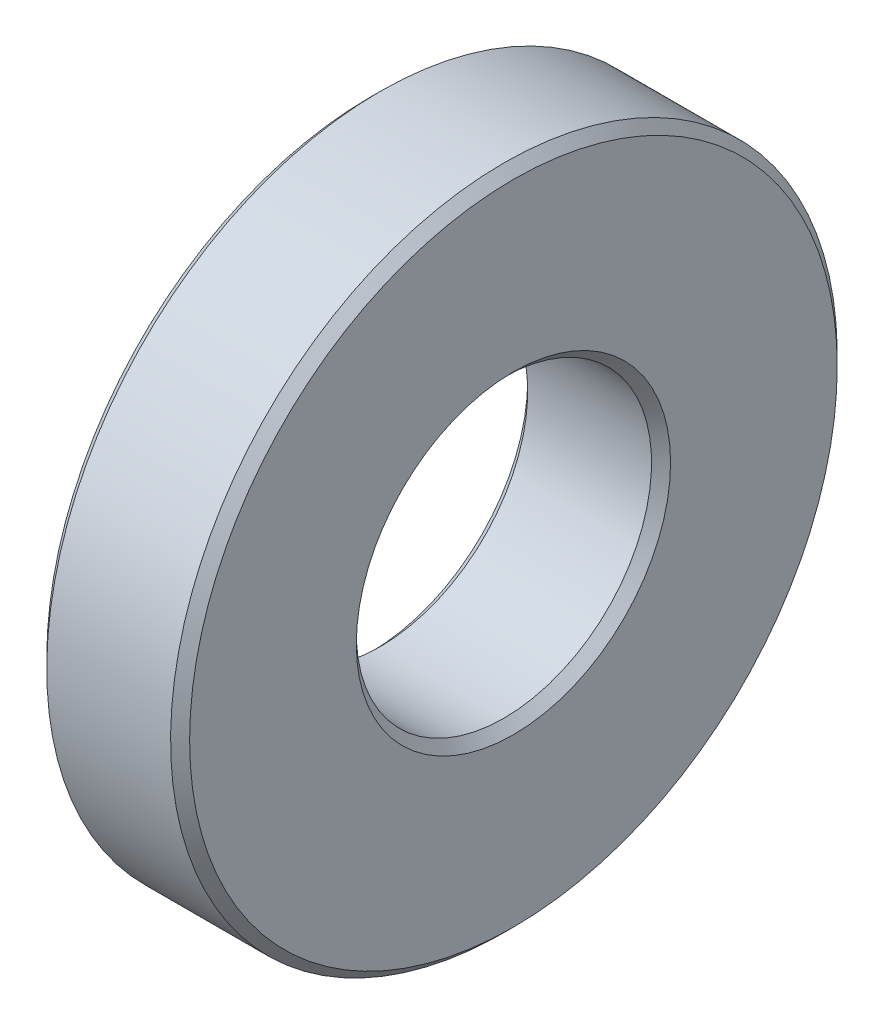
ISO-10303-21;
HEADER;
FILE_DESCRIPTION(('STEP AP214'),'2;1');
FILE_NAME('part.step','',(''),(''),'','','');
FILE_SCHEMA(('AUTOMOTIVE_DESIGN { 1 0 10303 214 1 1 1 1 }'));
ENDSEC;
DATA;
#1=APPLICATION_CONTEXT('core data for automotive mechanical design processes');
#2=APPLICATION_PROTOCOL_DEFINITION('international standard','automotive_design',2000,#1);
#3=PRODUCT_CONTEXT('',#1,'mechanical');
#4=PRODUCT('Part','Part','',(#3));
#5=PRODUCT_RELATED_PRODUCT_CATEGORY('part','',(#4));
#6=PRODUCT_DEFINITION_FORMATION('','',#4);
#7=PRODUCT_DEFINITION_CONTEXT('part definition',#1,'design');
#8=PRODUCT_DEFINITION('design','',#6,#7);
#9=PRODUCT_DEFINITION_SHAPE('','',#8);
#10=(LENGTH_UNIT() NAMED_UNIT(*) SI_UNIT(.MILLI.,.METRE.));
#11=(NAMED_UNIT(*) PLANE_ANGLE_UNIT() SI_UNIT($,.RADIAN.));
#12=(NAMED_UNIT(*) SI_UNIT($,.STERADIAN.) SOLID_ANGLE_UNIT());
#13=UNCERTAINTY_MEASURE_WITH_UNIT(LENGTH_MEASURE(1.E-05),#10,'distance_accuracy_value','');
#14=(GEOMETRIC_REPRESENTATION_CONTEXT(3) GLOBAL_UNCERTAINTY_ASSIGNED_CONTEXT((#13)) GLOBAL_UNIT_ASSIGNED_CONTEXT((#10,
#11,#12)) REPRESENTATION_CONTEXT('',''));
#15=CARTESIAN_POINT('',(0.,0.,0.));
#16=DIRECTION('',(0.,0.,1.));
#17=DIRECTION('',(1.,0.,0.));
#18=AXIS2_PLACEMENT_3D('',#15,#16,#17);
#19=DIRECTION('',(0.707106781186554,0.707106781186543,0.));
#20=VECTOR('',#19,1.);
#21=CARTESIAN_POINT('',(498933.550000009,499000.000000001,-30.5000000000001));
#22=LINE('',#21,#20);
#23=CARTESIAN_POINT('',(-50.7,15.75,-30.5000000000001));
#24=DIRECTION('',(1.,0.,0.));
#25=AXIS1_PLACEMENT('',#23,#24);
#26=SURFACE_OF_REVOLUTION('',#22,#25);
#27=CARTESIAN_POINT('',(-47.5999999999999,15.75,-30.5000000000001));
#28=DIRECTION('',(1.,0.,0.));
#29=DIRECTION('',(0.,1.,0.));
#30=AXIS2_PLACEMENT_3D('',#27,#28,#29);
#31=CIRCLE('',#30,3.1);
#32=CARTESIAN_POINT('',(-47.5999999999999,18.8500000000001,-30.5000000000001));
#33=VERTEX_POINT('',#32);
#34=EDGE_CURVE('E39',#33,#33,#31,.T.);
#35=ORIENTED_EDGE('',*,*,#34,.F.);
#36=EDGE_LOOP('',(#35));
#37=FACE_BOUND('',#36,.T.);
#38=CARTESIAN_POINT('',(-47.3999999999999,15.75,-30.5000000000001));
#39=DIRECTION('',(1.,0.,0.));
#40=DIRECTION('',(0.,1.,0.));
#41=AXIS2_PLACEMENT_3D('',#38,#39,#40);
#42=CIRCLE('',#41,3.3);
#43=CARTESIAN_POINT('',(-47.3999999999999,19.0500000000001,-30.5000000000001));
#44=VERTEX_POINT('',#43);
#45=EDGE_CURVE('E8',#44,#44,#42,.T.);
#46=ORIENTED_EDGE('',*,*,#45,.T.);
#47=EDGE_LOOP('',(#46));
#48=FACE_BOUND('',#47,.T.);
#49=ADVANCED_FACE('F12',(#37,#48),#26,.F.);
#50=CARTESIAN_POINT('',(-47.3999999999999,20.8000000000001,-30.5000000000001));
#51=DIRECTION('',(1.,0.,0.));
#52=DIRECTION('',(0.,0.,-1.));
#53=AXIS2_PLACEMENT_3D('',#50,#51,#52);
#54=PLANE('',#53);
#55=CARTESIAN_POINT('',(-47.3999999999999,15.75,-30.5000000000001));
#56=DIRECTION('',(1.,0.,0.));
#57=DIRECTION('',(0.,1.,0.));
#58=AXIS2_PLACEMENT_3D('',#55,#56,#57);
#59=CIRCLE('',#58,6.8);
#60=CARTESIAN_POINT('',(-47.3999999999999,22.5500000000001,-30.5000000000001));
#61=VERTEX_POINT('',#60);
#62=EDGE_CURVE('E21',#61,#61,#59,.T.);
#63=ORIENTED_EDGE('',*,*,#62,.T.);
#64=EDGE_LOOP('',(#63));
#65=FACE_BOUND('',#64,.T.);
#66=ORIENTED_EDGE('',*,*,#45,.F.);
#67=EDGE_LOOP('',(#66));
#68=FACE_BOUND('',#67,.T.);
#69=ADVANCED_FACE('F58',(#65,#68),#54,.T.);
#70=DIRECTION('',(0.707106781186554,-0.707106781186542,0.));
#71=VECTOR('',#70,1.);
#72=CARTESIAN_POINT('',(-499000.,498975.149999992,-30.5000000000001));
#73=LINE('',#72,#71);
#74=CARTESIAN_POINT('',(-40.5999999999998,15.75,-30.5000000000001));
#75=DIRECTION('',(-1.,0.,0.));
#76=AXIS1_PLACEMENT('',#74,#75);
#77=SURFACE_OF_REVOLUTION('',#73,#76);
#78=CARTESIAN_POINT('',(-47.5999999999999,15.75,-30.5000000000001));
#79=DIRECTION('',(1.,0.,0.));
#80=DIRECTION('',(0.,1.,0.));
#81=AXIS2_PLACEMENT_3D('',#78,#79,#80);
#82=CIRCLE('',#81,7.);
#83=CARTESIAN_POINT('',(-47.5999999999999,22.7500000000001,-30.5000000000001));
#84=VERTEX_POINT('',#83);
#85=EDGE_CURVE('E34',#84,#84,#82,.T.);
#86=ORIENTED_EDGE('',*,*,#85,.T.);
#87=EDGE_LOOP('',(#86));
#88=FACE_BOUND('',#87,.T.);
#89=ORIENTED_EDGE('',*,*,#62,.F.);
#90=EDGE_LOOP('',(#89));
#91=FACE_BOUND('',#90,.T.);
#92=ADVANCED_FACE('F62',(#88,#91),#77,.F.);
#93=CARTESIAN_POINT('',(-48.9,15.75,-30.5000000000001));
#94=DIRECTION('',(-1.,0.,0.));
#95=DIRECTION('',(0.,0.,1.));
#96=AXIS2_PLACEMENT_3D('',#93,#94,#95);
#97=CYLINDRICAL_SURFACE('',#96,7.);
#98=CARTESIAN_POINT('',(-50.2000000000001,15.75,-30.5000000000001));
#99=DIRECTION('',(1.,0.,0.));
#100=DIRECTION('',(0.,1.,0.));
#101=AXIS2_PLACEMENT_3D('',#98,#99,#100);
#102=CIRCLE('',#101,7.);
#103=CARTESIAN_POINT('',(-50.2000000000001,22.7500000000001,-30.5000000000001));
#104=VERTEX_POINT('',#103);
#105=EDGE_CURVE('E30',#104,#104,#102,.T.);
#106=ORIENTED_EDGE('',*,*,#105,.T.);
#107=EDGE_LOOP('',(#106));
#108=FACE_BOUND('',#107,.T.);
#109=ORIENTED_EDGE('',*,*,#85,.F.);
#110=EDGE_LOOP('',(#109));
#111=FACE_BOUND('',#110,.T.);
#112=ADVANCED_FACE('F66',(#108,#111),#97,.T.);
#113=DIRECTION('',(-0.707106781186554,-0.707106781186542,0.));
#114=VECTOR('',#113,1.);
#115=CARTESIAN_POINT('',(498927.050000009,499000.000000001,-30.5000000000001));
#116=LINE('',#115,#114);
#117=CARTESIAN_POINT('',(-57.2000000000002,15.75,-30.5000000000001));
#118=DIRECTION('',(1.,0.,0.));
#119=AXIS1_PLACEMENT('',#117,#118);
#120=SURFACE_OF_REVOLUTION('',#116,#119);
#121=CARTESIAN_POINT('',(-50.4000000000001,15.75,-30.5000000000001));
#122=DIRECTION('',(1.,0.,0.));
#123=DIRECTION('',(0.,1.,0.));
#124=AXIS2_PLACEMENT_3D('',#121,#122,#123);
#125=CIRCLE('',#124,6.8);
#126=CARTESIAN_POINT('',(-50.4000000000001,22.5500000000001,-30.5000000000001));
#127=VERTEX_POINT('',#126);
#128=EDGE_CURVE('E38',#127,#127,#125,.T.);
#129=ORIENTED_EDGE('',*,*,#128,.T.);
#130=EDGE_LOOP('',(#129));
#131=FACE_BOUND('',#130,.T.);
#132=ORIENTED_EDGE('',*,*,#105,.F.);
#133=EDGE_LOOP('',(#132));
#134=FACE_BOUND('',#133,.T.);
#135=ADVANCED_FACE('F70',(#131,#134),#120,.F.);
#136=CARTESIAN_POINT('',(-50.4000000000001,20.8000000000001,-30.5000000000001));
#137=DIRECTION('',(-1.,0.,0.));
#138=DIRECTION('',(0.,0.,1.));
#139=AXIS2_PLACEMENT_3D('',#136,#137,#138);
#140=PLANE('',#139);
#141=CARTESIAN_POINT('',(-50.4000000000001,15.75,-30.5000000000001));
#142=DIRECTION('',(1.,0.,0.));
#143=DIRECTION('',(0.,1.,0.));
#144=AXIS2_PLACEMENT_3D('',#141,#142,#143);
#145=CIRCLE('',#144,3.3);
#146=CARTESIAN_POINT('',(-50.4000000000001,19.0500000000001,-30.5000000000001));
#147=VERTEX_POINT('',#146);
#148=EDGE_CURVE('E35',#147,#147,#145,.T.);
#149=ORIENTED_EDGE('',*,*,#148,.T.);
#150=EDGE_LOOP('',(#149));
#151=FACE_BOUND('',#150,.T.);
#152=ORIENTED_EDGE('',*,*,#128,.F.);
#153=EDGE_LOOP('',(#152));
#154=FACE_BOUND('',#153,.T.);
#155=ADVANCED_FACE('F74',(#151,#154),#140,.T.);
#156=DIRECTION('',(-0.707106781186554,0.707106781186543,0.));
#157=VECTOR('',#156,1.);
#158=CARTESIAN_POINT('',(-499000.,498968.649999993,-30.5000000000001));
#159=LINE('',#158,#157);
#160=CARTESIAN_POINT('',(-47.1,15.75,-30.5000000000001));
#161=DIRECTION('',(-1.,0.,0.));
#162=AXIS1_PLACEMENT('',#160,#161);
#163=SURFACE_OF_REVOLUTION('',#159,#162);
#164=ORIENTED_EDGE('',*,*,#148,.F.);
#165=EDGE_LOOP('',(#164));
#166=FACE_BOUND('',#165,.T.);
#167=CARTESIAN_POINT('',(-50.2000000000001,15.75,-30.5000000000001));
#168=DIRECTION('',(1.,0.,0.));
#169=DIRECTION('',(0.,1.,0.));
#170=AXIS2_PLACEMENT_3D('',#167,#168,#169);
#171=CIRCLE('',#170,3.1);
#172=CARTESIAN_POINT('',(-50.2000000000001,18.8500000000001,-30.5000000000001));
#173=VERTEX_POINT('',#172);
#174=EDGE_CURVE('E46',#173,#173,#171,.T.);
#175=ORIENTED_EDGE('',*,*,#174,.T.);
#176=EDGE_LOOP('',(#175));
#177=FACE_BOUND('',#176,.T.);
#178=ADVANCED_FACE('F78',(#166,#177),#163,.F.);
#179=CARTESIAN_POINT('',(-48.9,15.75,-30.5000000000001));
#180=DIRECTION('',(-1.,0.,0.));
#181=DIRECTION('',(0.,0.,1.));
#182=AXIS2_PLACEMENT_3D('',#179,#180,#181);
#183=CYLINDRICAL_SURFACE('',#182,3.1);
#184=ORIENTED_EDGE('',*,*,#174,.F.);
#185=EDGE_LOOP('',(#184));
#186=FACE_BOUND('',#185,.T.);
#187=ORIENTED_EDGE('',*,*,#34,.T.);
#188=EDGE_LOOP('',(#187));
#189=FACE_BOUND('',#188,.T.);
#190=ADVANCED_FACE('F14',(#186,#189),#183,.F.);
#191=CLOSED_SHELL('',(#49,#69,#92,#112,#135,#155,#178,#190));
#192=MANIFOLD_SOLID_BREP('B1',#191);
#193=ADVANCED_BREP_SHAPE_REPRESENTATION('',(#18,#192),#14);
#194=SHAPE_DEFINITION_REPRESENTATION(#9,#193);
ENDSEC;
END-ISO-10303-21;
